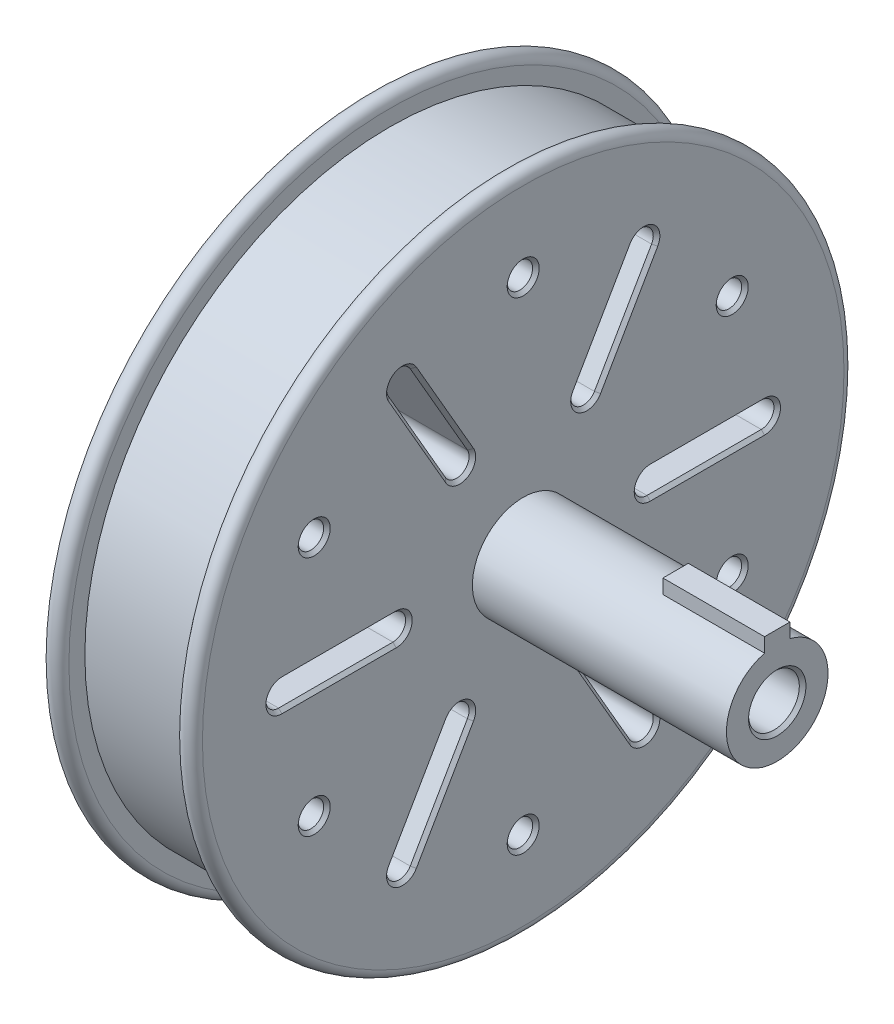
from build123d import *

# Parameters (mm, degrees)
EXTRUDE1_START     = -25.4
EXTRUDE1_DEPTH     = 25.4
SKETCH3_R          = 3.175
CUT_EXTRUDE1_DEPTH = 155.762931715
CUT_EXTRUDE2_DEPTH = 133.895654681
CHAMFER1_SIZE      = 0.8255


with BuildPart() as part:
    # Sketch1 → Revolve1 (revolve)
    with BuildSketch(Plane.XY, mode=Mode.PRIVATE) as revolve1_sk:
        with BuildLine():
            Line((63.5, 12.7), (0, 12.7))
            Line((0, 12.7), (0, 80.1878))
            ThreePointArc((0, 80.1878), (-2.3622, 82.55), (-4.7244, 80.1878))
            Line((-4.7244, 80.1878), (-4.7244, 76.2))
            Line((-4.7244, 76.2), (-33.3756, 76.2))
            Line((-33.3756, 76.2), (-33.3756, 80.1878))
            ThreePointArc((-33.3756, 80.1878), (-35.7378, 82.55), (-38.1, 80.1878))
            Line((-38.1, 80.1878), (-38.1, 23.8125))
            Line((-38.1, 23.8125), (-36.5125, 22.225))
            Line((-36.5125, 22.225), (-19.05, 22.225))
            Line((-19.05, 22.225), (-19.05, 6.35))
            Line((-19.05, 6.35), (63.5, 6.35))
            Line((63.5, 6.35), (63.5, 12.7))
        make_face()
    revolve(revolve1_sk.sketch.rotate(Axis((0, 0, 0), (-1, 0, 0)), 90), axis=Axis((0, 0, 0), (-1, 0, 0)))

    # Sketch2 → Extrude1 (add)
    with BuildSketch(Plane(origin=(63.5, 0, 0), x_dir=(0, 0, -1), z_dir=(1, 0, 0)).offset(EXTRUDE1_START)):
        with BuildLine():
            Line((-3.175, 12.296722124), (-3.175, 15.875))
            Line((-3.175, 15.875), (3.175, 15.875))
            Line((3.175, 15.875), (3.175, 12.296722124))
            ThreePointArc((3.175, 12.296722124), (0, 12.7), (-3.175, 12.296722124))
        make_face()
    extrude(amount=EXTRUDE1_DEPTH)

    # Sketch3 → Cut-Extrude1 (cut, through all)
    with BuildSketch(Plane.ZY.offset(38.1)):
        with Locations((0, 60.325)):
            Circle(SKETCH3_R)
        with Locations((52.242982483, 30.1625)):
            Circle(SKETCH3_R)
        with Locations((52.242982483, -30.1625)):
            Circle(SKETCH3_R)
        with Locations((0, -60.325)):
            Circle(SKETCH3_R)
        with Locations((-52.242982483, -30.1625)):
            Circle(SKETCH3_R)
        with Locations((-52.242982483, 30.1625)):
            Circle(SKETCH3_R)
    extrude(amount=-CUT_EXTRUDE1_DEPTH, mode=Mode.SUBTRACT)

    # Sketch4 → Cut-Extrude2 (cut, through all)
    with BuildSketch(Plane(origin=(0, 0, 0), x_dir=(0, 0, -1), z_dir=(1, 0, 0))):
        with BuildLine():
            Line((18.624630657, 25.90880657), (32.912130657, 50.655482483))
            ThreePointArc((32.912130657, 50.655482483), (31.75, 54.99261314), (27.412869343, 53.830482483))
            Line((27.412869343, 53.830482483), (13.125369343, 29.08380657))
            ThreePointArc((13.125369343, 29.08380657), (14.2875, 24.746675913), (18.624630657, 25.90880657))
        make_face()
        with BuildLine():
            Line((31.75, -3.175), (60.325, -3.175))
            ThreePointArc((60.325, -3.175), (63.5, 0), (60.325, 3.175))
            Line((60.325, 3.175), (31.75, 3.175))
            ThreePointArc((31.75, 3.175), (28.575, 0), (31.75, -3.175))
        make_face()
        with BuildLine():
            Line((13.125369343, -29.08380657), (27.412869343, -53.830482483))
            ThreePointArc((27.412869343, -53.830482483), (31.75, -54.99261314), (32.912130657, -50.655482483))
            Line((32.912130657, -50.655482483), (18.624630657, -25.90880657))
            ThreePointArc((18.624630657, -25.90880657), (14.2875, -24.746675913), (13.125369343, -29.08380657))
        make_face()
        with BuildLine():
            Line((-18.624630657, -25.90880657), (-32.912130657, -50.655482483))
            ThreePointArc((-32.912130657, -50.655482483), (-31.75, -54.99261314), (-27.412869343, -53.830482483))
            Line((-27.412869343, -53.830482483), (-13.125369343, -29.08380657))
            ThreePointArc((-13.125369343, -29.08380657), (-14.2875, -24.746675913), (-18.624630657, -25.90880657))
        make_face()
        with BuildLine():
            Line((-31.75, 3.175), (-60.325, 3.175))
            ThreePointArc((-60.325, 3.175), (-63.5, 0), (-60.325, -3.175))
            Line((-60.325, -3.175), (-31.75, -3.175))
            ThreePointArc((-31.75, -3.175), (-28.575, 0), (-31.75, 3.175))
        make_face()
        with BuildLine():
            Line((-13.125369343, 29.08380657), (-27.412869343, 53.830482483))
            ThreePointArc((-27.412869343, 53.830482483), (-31.75, 54.99261314), (-32.912130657, 50.655482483))
            Line((-32.912130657, 50.655482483), (-18.624630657, 25.90880657))
            ThreePointArc((-18.624630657, 25.90880657), (-14.2875, 24.746675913), (-13.125369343, 29.08380657))
        make_face()
    extrude(amount=-CUT_EXTRUDE2_DEPTH, mode=Mode.SUBTRACT)

    # Chamfer1
    chamfer1_edges = [part.edges().sort_by_distance(p)[0] for p in [
        (-38.1, -24.746675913, 14.2875),
        (-38.1, -41.457144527, 20.269119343),
        (-38.1, -54.99261314, 31.75),
        (-38.1, -38.282144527, 25.768380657),
        (0, -24.746675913, 14.2875),
        (0, -38.282144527, 25.768380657),
        (0, -54.99261314, 31.75),
        (0, -41.457144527, 20.269119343),
        (-38.1, 0, 28.575),
        (-38.1, -3.175, 46.0375),
        (-38.1, 0, 63.5),
        (-38.1, 3.175, 46.0375),
        (0, 0, 28.575),
        (0, 3.175, 46.0375),
        (0, 0, 63.5),
        (0, -3.175, 46.0375),
        (63.5, 0, 6.35),
        (-38.1, 24.746675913, 14.2875),
        (-38.1, 38.282144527, 25.768380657),
        (-38.1, 54.99261314, 31.75),
        (-38.1, 41.457144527, 20.269119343),
        (0, 24.746675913, 14.2875),
        (0, 41.457144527, 20.269119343),
        (0, 54.99261314, 31.75),
        (0, 38.282144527, 25.768380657),
        (0, 60.325, -3.175),
        (-38.1, 60.325, -3.175),
        (0, 30.1625, 49.067982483),
        (-38.1, 30.1625, 49.067982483),
        (0, -30.1625, 49.067982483),
        (-38.1, -30.1625, 49.067982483),
        (0, -60.325, -3.175),
        (-38.1, -60.325, -3.175),
        (0, -30.1625, -55.417982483),
        (-38.1, -30.1625, -55.417982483),
        (0, 30.1625, -55.417982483),
        (-38.1, 30.1625, -55.417982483),
        (-38.1, 24.746675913, -14.2875),
        (-38.1, 41.457144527, -20.269119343),
        (-38.1, 54.99261314, -31.75),
        (-38.1, 38.282144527, -25.768380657),
        (0, 24.746675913, -14.2875),
        (0, 38.282144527, -25.768380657),
        (0, 54.99261314, -31.75),
        (0, 41.457144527, -20.269119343),
        (-38.1, 0, -28.575),
        (-38.1, 3.175, -46.0375),
        (-38.1, 0, -63.5),
        (-38.1, -3.175, -46.0375),
        (0, 0, -28.575),
        (0, -3.175, -46.0375),
        (0, 0, -63.5),
        (0, 3.175, -46.0375),
        (-38.1, -24.746675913, -14.2875),
        (-38.1, -38.282144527, -25.768380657),
        (-38.1, -54.99261314, -31.75),
        (-38.1, -41.457144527, -20.269119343),
        (0, -24.746675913, -14.2875),
        (0, -41.457144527, -20.269119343),
        (0, -54.99261314, -31.75),
        (0, -38.282144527, -25.768380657),
    ]]
    chamfer(chamfer1_edges, length=CHAMFER1_SIZE)


solid = part.part
